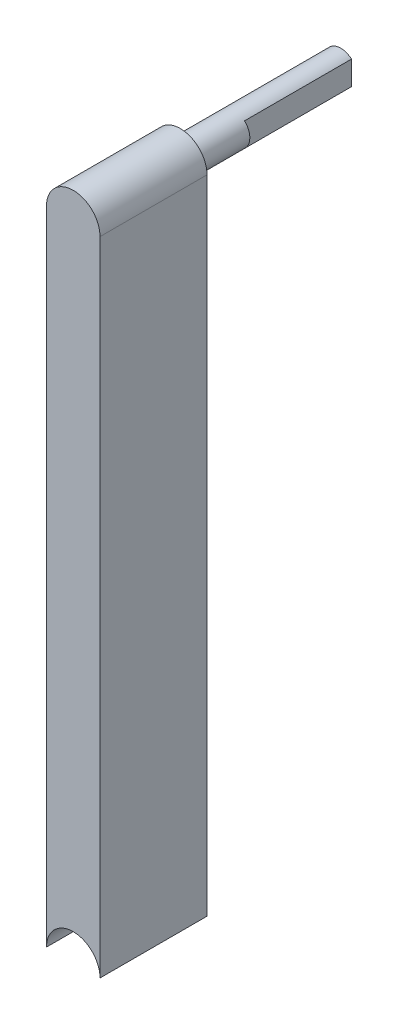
ISO-10303-21;
HEADER;
FILE_DESCRIPTION(('STEP AP214'),'2;1');
FILE_NAME('part.step','',(''),(''),'','','');
FILE_SCHEMA(('AUTOMOTIVE_DESIGN { 1 0 10303 214 1 1 1 1 }'));
ENDSEC;
DATA;
#1=APPLICATION_CONTEXT('core data for automotive mechanical design processes');
#2=APPLICATION_PROTOCOL_DEFINITION('international standard','automotive_design',2000,#1);
#3=PRODUCT_CONTEXT('',#1,'mechanical');
#4=PRODUCT('Part','Part','',(#3));
#5=PRODUCT_RELATED_PRODUCT_CATEGORY('part','',(#4));
#6=PRODUCT_DEFINITION_FORMATION('','',#4);
#7=PRODUCT_DEFINITION_CONTEXT('part definition',#1,'design');
#8=PRODUCT_DEFINITION('design','',#6,#7);
#9=PRODUCT_DEFINITION_SHAPE('','',#8);
#10=(LENGTH_UNIT() NAMED_UNIT(*) SI_UNIT(.MILLI.,.METRE.));
#11=(NAMED_UNIT(*) PLANE_ANGLE_UNIT() SI_UNIT($,.RADIAN.));
#12=(NAMED_UNIT(*) SI_UNIT($,.STERADIAN.) SOLID_ANGLE_UNIT());
#13=UNCERTAINTY_MEASURE_WITH_UNIT(LENGTH_MEASURE(1.E-05),#10,'distance_accuracy_value','');
#14=(GEOMETRIC_REPRESENTATION_CONTEXT(3) GLOBAL_UNCERTAINTY_ASSIGNED_CONTEXT((#13)) GLOBAL_UNIT_ASSIGNED_CONTEXT((#10,
#11,#12)) REPRESENTATION_CONTEXT('',''));
#15=CARTESIAN_POINT('',(0.,0.,0.));
#16=DIRECTION('',(0.,0.,1.));
#17=DIRECTION('',(1.,0.,0.));
#18=AXIS2_PLACEMENT_3D('',#15,#16,#17);
#19=CARTESIAN_POINT('',(0.,0.,0.));
#20=DIRECTION('',(0.,0.,1.));
#21=DIRECTION('',(1.,0.,0.));
#22=AXIS2_PLACEMENT_3D('',#19,#20,#21);
#23=PLANE('',#22);
#24=CARTESIAN_POINT('',(0.,0.,0.));
#25=DIRECTION('',(0.,0.,-1.));
#26=DIRECTION('',(1.,0.,0.));
#27=AXIS2_PLACEMENT_3D('',#24,#25,#26);
#28=CIRCLE('',#27,5.);
#29=CARTESIAN_POINT('',(-5.,0.,0.));
#30=VERTEX_POINT('',#29);
#31=CARTESIAN_POINT('',(5.,0.,0.));
#32=VERTEX_POINT('',#31);
#33=EDGE_CURVE('E114',#30,#32,#28,.T.);
#34=ORIENTED_EDGE('',*,*,#33,.F.);
#35=DIRECTION('',(0.,-1.,0.));
#36=VECTOR('',#35,1.);
#37=CARTESIAN_POINT('',(-5.00000000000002,120.,0.));
#38=LINE('',#37,#36);
#39=CARTESIAN_POINT('',(-5.00000000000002,120.,0.));
#40=VERTEX_POINT('',#39);
#41=EDGE_CURVE('E125',#40,#30,#38,.T.);
#42=ORIENTED_EDGE('',*,*,#41,.F.);
#43=CARTESIAN_POINT('',(0.,120.,0.));
#44=DIRECTION('',(0.,0.,1.));
#45=DIRECTION('',(1.,0.,0.));
#46=AXIS2_PLACEMENT_3D('',#43,#44,#45);
#47=CIRCLE('',#46,5.00000000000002);
#48=CARTESIAN_POINT('',(5.00000000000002,120.,0.));
#49=VERTEX_POINT('',#48);
#50=EDGE_CURVE('E123',#49,#40,#47,.T.);
#51=ORIENTED_EDGE('',*,*,#50,.F.);
#52=DIRECTION('',(0.,1.,0.));
#53=VECTOR('',#52,1.);
#54=CARTESIAN_POINT('',(5.00000000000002,120.,0.));
#55=LINE('',#54,#53);
#56=EDGE_CURVE('E121',#32,#49,#55,.T.);
#57=ORIENTED_EDGE('',*,*,#56,.F.);
#58=EDGE_LOOP('',(#34,#42,#51,#57));
#59=FACE_BOUND('',#58,.T.);
#60=CARTESIAN_POINT('',(0.,120.,0.));
#61=DIRECTION('',(0.,0.,1.));
#62=DIRECTION('',(1.,0.,0.));
#63=AXIS2_PLACEMENT_3D('',#60,#61,#62);
#64=CIRCLE('',#63,3.);
#65=CARTESIAN_POINT('',(3.00000000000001,120.,0.));
#66=VERTEX_POINT('',#65);
#67=EDGE_CURVE('E149',#66,#66,#64,.F.);
#68=ORIENTED_EDGE('',*,*,#67,.F.);
#69=EDGE_LOOP('',(#68));
#70=FACE_BOUND('',#69,.T.);
#71=ADVANCED_FACE('F32',(#59,#70),#23,.F.);
#72=CARTESIAN_POINT('',(0.,0.,20.));
#73=DIRECTION('',(0.,0.,-1.));
#74=DIRECTION('',(-1.,0.,0.));
#75=AXIS2_PLACEMENT_3D('',#72,#73,#74);
#76=CYLINDRICAL_SURFACE('',#75,5.);
#77=ORIENTED_EDGE('',*,*,#33,.T.);
#78=DIRECTION('',(0.,0.,-1.));
#79=VECTOR('',#78,1.);
#80=CARTESIAN_POINT('',(5.,0.,20.));
#81=LINE('',#80,#79);
#82=CARTESIAN_POINT('',(5.,0.,20.));
#83=VERTEX_POINT('',#82);
#84=EDGE_CURVE('E146',#83,#32,#81,.T.);
#85=ORIENTED_EDGE('',*,*,#84,.F.);
#86=CARTESIAN_POINT('',(0.,0.,20.));
#87=DIRECTION('',(0.,0.,-1.));
#88=DIRECTION('',(1.,0.,0.));
#89=AXIS2_PLACEMENT_3D('',#86,#87,#88);
#90=CIRCLE('',#89,5.);
#91=CARTESIAN_POINT('',(-5.,0.,20.));
#92=VERTEX_POINT('',#91);
#93=EDGE_CURVE('E127',#92,#83,#90,.T.);
#94=ORIENTED_EDGE('',*,*,#93,.F.);
#95=DIRECTION('',(0.,0.,-1.));
#96=VECTOR('',#95,1.);
#97=CARTESIAN_POINT('',(-5.,0.,20.));
#98=LINE('',#97,#96);
#99=EDGE_CURVE('E137',#92,#30,#98,.T.);
#100=ORIENTED_EDGE('',*,*,#99,.T.);
#101=EDGE_LOOP('',(#77,#85,#94,#100));
#102=FACE_BOUND('',#101,.T.);
#103=ADVANCED_FACE('F34',(#102),#76,.F.);
#104=CARTESIAN_POINT('',(5.00000000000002,120.,20.));
#105=DIRECTION('',(-1.,0.,0.));
#106=DIRECTION('',(0.,-1.,0.));
#107=AXIS2_PLACEMENT_3D('',#104,#105,#106);
#108=PLANE('',#107);
#109=ORIENTED_EDGE('',*,*,#56,.T.);
#110=DIRECTION('',(0.,0.,-1.));
#111=VECTOR('',#110,1.);
#112=CARTESIAN_POINT('',(5.00000000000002,120.,20.));
#113=LINE('',#112,#111);
#114=CARTESIAN_POINT('',(5.00000000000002,120.,20.));
#115=VERTEX_POINT('',#114);
#116=EDGE_CURVE('E143',#115,#49,#113,.T.);
#117=ORIENTED_EDGE('',*,*,#116,.F.);
#118=DIRECTION('',(0.,1.,0.));
#119=VECTOR('',#118,1.);
#120=CARTESIAN_POINT('',(5.00000000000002,120.,20.));
#121=LINE('',#120,#119);
#122=EDGE_CURVE('E130',#83,#115,#121,.T.);
#123=ORIENTED_EDGE('',*,*,#122,.F.);
#124=ORIENTED_EDGE('',*,*,#84,.T.);
#125=EDGE_LOOP('',(#109,#117,#123,#124));
#126=FACE_BOUND('',#125,.T.);
#127=ADVANCED_FACE('F182',(#126),#108,.F.);
#128=CARTESIAN_POINT('',(0.,120.,20.));
#129=DIRECTION('',(0.,0.,-1.));
#130=DIRECTION('',(-1.,0.,0.));
#131=AXIS2_PLACEMENT_3D('',#128,#129,#130);
#132=CYLINDRICAL_SURFACE('',#131,5.00000000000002);
#133=ORIENTED_EDGE('',*,*,#50,.T.);
#134=DIRECTION('',(0.,0.,-1.));
#135=VECTOR('',#134,1.);
#136=CARTESIAN_POINT('',(-5.00000000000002,120.,20.));
#137=LINE('',#136,#135);
#138=CARTESIAN_POINT('',(-5.00000000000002,120.,20.));
#139=VERTEX_POINT('',#138);
#140=EDGE_CURVE('E140',#139,#40,#137,.T.);
#141=ORIENTED_EDGE('',*,*,#140,.F.);
#142=CARTESIAN_POINT('',(0.,120.,20.));
#143=DIRECTION('',(0.,0.,1.));
#144=DIRECTION('',(1.,0.,0.));
#145=AXIS2_PLACEMENT_3D('',#142,#143,#144);
#146=CIRCLE('',#145,5.00000000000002);
#147=EDGE_CURVE('E131',#115,#139,#146,.T.);
#148=ORIENTED_EDGE('',*,*,#147,.F.);
#149=ORIENTED_EDGE('',*,*,#116,.T.);
#150=EDGE_LOOP('',(#133,#141,#148,#149));
#151=FACE_BOUND('',#150,.T.);
#152=ADVANCED_FACE('F196',(#151),#132,.T.);
#153=CARTESIAN_POINT('',(-5.00000000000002,120.,20.));
#154=DIRECTION('',(1.,0.,0.));
#155=DIRECTION('',(0.,1.,0.));
#156=AXIS2_PLACEMENT_3D('',#153,#154,#155);
#157=PLANE('',#156);
#158=ORIENTED_EDGE('',*,*,#41,.T.);
#159=ORIENTED_EDGE('',*,*,#99,.F.);
#160=DIRECTION('',(0.,-1.,0.));
#161=VECTOR('',#160,1.);
#162=CARTESIAN_POINT('',(-5.00000000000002,120.,20.));
#163=LINE('',#162,#161);
#164=EDGE_CURVE('E135',#139,#92,#163,.T.);
#165=ORIENTED_EDGE('',*,*,#164,.F.);
#166=ORIENTED_EDGE('',*,*,#140,.T.);
#167=EDGE_LOOP('',(#158,#159,#165,#166));
#168=FACE_BOUND('',#167,.T.);
#169=ADVANCED_FACE('F192',(#168),#157,.F.);
#170=CARTESIAN_POINT('',(0.,0.,20.));
#171=DIRECTION('',(0.,0.,1.));
#172=DIRECTION('',(1.,0.,0.));
#173=AXIS2_PLACEMENT_3D('',#170,#171,#172);
#174=PLANE('',#173);
#175=ORIENTED_EDGE('',*,*,#93,.T.);
#176=ORIENTED_EDGE('',*,*,#122,.T.);
#177=ORIENTED_EDGE('',*,*,#147,.T.);
#178=ORIENTED_EDGE('',*,*,#164,.T.);
#179=EDGE_LOOP('',(#175,#176,#177,#178));
#180=FACE_BOUND('',#179,.T.);
#181=ADVANCED_FACE('F189',(#180),#174,.T.);
#182=CARTESIAN_POINT('',(0.,120.,40.781210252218));
#183=DIRECTION('',(0.,0.,1.));
#184=DIRECTION('',(1.,0.,0.));
#185=AXIS2_PLACEMENT_3D('',#182,#183,#184);
#186=CYLINDRICAL_SURFACE('',#185,3.);
#187=CARTESIAN_POINT('',(0.,120.,-30.));
#188=DIRECTION('',(0.,0.,1.));
#189=DIRECTION('',(1.,0.,0.));
#190=AXIS2_PLACEMENT_3D('',#187,#188,#189);
#191=CIRCLE('',#190,3.);
#192=CARTESIAN_POINT('',(-2.,117.7639320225,-30.));
#193=VERTEX_POINT('',#192);
#194=CARTESIAN_POINT('',(2.,117.7639320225,-30.));
#195=VERTEX_POINT('',#194);
#196=EDGE_CURVE('E111',#193,#195,#191,.T.);
#197=ORIENTED_EDGE('',*,*,#196,.T.);
#198=DIRECTION('',(0.,0.,1.));
#199=VECTOR('',#198,1.);
#200=CARTESIAN_POINT('',(2.,117.7639320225,40.781210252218));
#201=LINE('',#200,#199);
#202=CARTESIAN_POINT('',(2.,117.7639320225,-9.99999999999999));
#203=VERTEX_POINT('',#202);
#204=EDGE_CURVE('E47',#195,#203,#201,.T.);
#205=ORIENTED_EDGE('',*,*,#204,.T.);
#206=CARTESIAN_POINT('',(0.,120.,-9.99999999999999));
#207=DIRECTION('',(0.,0.,-1.));
#208=DIRECTION('',(-1.,0.,0.));
#209=AXIS2_PLACEMENT_3D('',#206,#207,#208);
#210=CIRCLE('',#209,3.);
#211=CARTESIAN_POINT('',(2.,122.2360679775,-9.99999999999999));
#212=VERTEX_POINT('',#211);
#213=EDGE_CURVE('E12',#212,#203,#210,.T.);
#214=ORIENTED_EDGE('',*,*,#213,.F.);
#215=DIRECTION('',(0.,0.,1.));
#216=VECTOR('',#215,1.);
#217=CARTESIAN_POINT('',(2.,122.2360679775,40.781210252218));
#218=LINE('',#217,#216);
#219=CARTESIAN_POINT('',(2.,122.2360679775,-30.));
#220=VERTEX_POINT('',#219);
#221=EDGE_CURVE('E97',#212,#220,#218,.F.);
#222=ORIENTED_EDGE('',*,*,#221,.T.);
#223=CARTESIAN_POINT('',(-2.,122.2360679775,-30.));
#224=VERTEX_POINT('',#223);
#225=EDGE_CURVE('E55',#220,#224,#191,.T.);
#226=ORIENTED_EDGE('',*,*,#225,.T.);
#227=DIRECTION('',(0.,0.,1.));
#228=VECTOR('',#227,1.);
#229=CARTESIAN_POINT('',(-2.,122.2360679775,40.781210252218));
#230=LINE('',#229,#228);
#231=CARTESIAN_POINT('',(-2.,122.2360679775,-9.99999999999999));
#232=VERTEX_POINT('',#231);
#233=EDGE_CURVE('E112',#224,#232,#230,.T.);
#234=ORIENTED_EDGE('',*,*,#233,.T.);
#235=CARTESIAN_POINT('',(0.,120.,-9.99999999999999));
#236=DIRECTION('',(0.,0.,-1.));
#237=DIRECTION('',(-1.,0.,0.));
#238=AXIS2_PLACEMENT_3D('',#235,#236,#237);
#239=CIRCLE('',#238,3.);
#240=CARTESIAN_POINT('',(-2.,117.7639320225,-10.));
#241=VERTEX_POINT('',#240);
#242=EDGE_CURVE('E102',#241,#232,#239,.T.);
#243=ORIENTED_EDGE('',*,*,#242,.F.);
#244=DIRECTION('',(0.,0.,1.));
#245=VECTOR('',#244,1.);
#246=CARTESIAN_POINT('',(-2.,117.7639320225,40.781210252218));
#247=LINE('',#246,#245);
#248=EDGE_CURVE('E115',#241,#193,#247,.F.);
#249=ORIENTED_EDGE('',*,*,#248,.T.);
#250=EDGE_LOOP('',(#197,#205,#214,#222,#226,#234,#243,#249));
#251=FACE_BOUND('',#250,.T.);
#252=ORIENTED_EDGE('',*,*,#67,.T.);
#253=EDGE_LOOP('',(#252));
#254=FACE_BOUND('',#253,.T.);
#255=ADVANCED_FACE('F104',(#251,#254),#186,.T.);
#256=CARTESIAN_POINT('',(-2.97258733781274,120.404628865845,-30.));
#257=DIRECTION('',(0.,0.,1.));
#258=DIRECTION('',(1.,0.,0.));
#259=AXIS2_PLACEMENT_3D('',#256,#257,#258);
#260=PLANE('',#259);
#261=ORIENTED_EDGE('',*,*,#225,.F.);
#262=DIRECTION('',(0.,-1.,0.));
#263=VECTOR('',#262,1.);
#264=CARTESIAN_POINT('',(2.,120.404628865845,-30.));
#265=LINE('',#264,#263);
#266=EDGE_CURVE('E40',#220,#195,#265,.T.);
#267=ORIENTED_EDGE('',*,*,#266,.T.);
#268=ORIENTED_EDGE('',*,*,#196,.F.);
#269=DIRECTION('',(0.,1.,0.));
#270=VECTOR('',#269,1.);
#271=CARTESIAN_POINT('',(-2.,120.404628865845,-30.));
#272=LINE('',#271,#270);
#273=EDGE_CURVE('E110',#193,#224,#272,.T.);
#274=ORIENTED_EDGE('',*,*,#273,.T.);
#275=EDGE_LOOP('',(#261,#267,#268,#274));
#276=FACE_BOUND('',#275,.T.);
#277=ADVANCED_FACE('F109',(#276),#260,.F.);
#278=CARTESIAN_POINT('',(0.141542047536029,119.98073328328,-10.));
#279=DIRECTION('',(0.,0.,-1.));
#280=DIRECTION('',(-1.,0.,0.));
#281=AXIS2_PLACEMENT_3D('',#278,#279,#280);
#282=PLANE('',#281);
#283=ORIENTED_EDGE('',*,*,#242,.T.);
#284=DIRECTION('',(0.,-1.,0.));
#285=VECTOR('',#284,1.);
#286=CARTESIAN_POINT('',(-2.,110.21273463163,-10.));
#287=LINE('',#286,#285);
#288=EDGE_CURVE('E158',#232,#241,#287,.T.);
#289=ORIENTED_EDGE('',*,*,#288,.T.);
#290=EDGE_LOOP('',(#283,#289));
#291=FACE_BOUND('',#290,.T.);
#292=ADVANCED_FACE('F157',(#291),#282,.T.);
#293=CARTESIAN_POINT('',(-2.,110.21273463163,-10.));
#294=DIRECTION('',(1.,0.,0.));
#295=DIRECTION('',(0.,1.,0.));
#296=AXIS2_PLACEMENT_3D('',#293,#294,#295);
#297=PLANE('',#296);
#298=ORIENTED_EDGE('',*,*,#273,.F.);
#299=ORIENTED_EDGE('',*,*,#248,.F.);
#300=ORIENTED_EDGE('',*,*,#288,.F.);
#301=ORIENTED_EDGE('',*,*,#233,.F.);
#302=EDGE_LOOP('',(#298,#299,#300,#301));
#303=FACE_BOUND('',#302,.T.);
#304=ADVANCED_FACE('F161',(#303),#297,.F.);
#305=CARTESIAN_POINT('',(0.141542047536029,119.98073328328,-10.));
#306=DIRECTION('',(0.,0.,-1.));
#307=DIRECTION('',(-1.,0.,0.));
#308=AXIS2_PLACEMENT_3D('',#305,#306,#307);
#309=PLANE('',#308);
#310=ORIENTED_EDGE('',*,*,#213,.T.);
#311=DIRECTION('',(0.,1.,0.));
#312=VECTOR('',#311,1.);
#313=CARTESIAN_POINT('',(2.00000000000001,129.806522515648,-10.));
#314=LINE('',#313,#312);
#315=EDGE_CURVE('E106',#203,#212,#314,.T.);
#316=ORIENTED_EDGE('',*,*,#315,.T.);
#317=EDGE_LOOP('',(#310,#316));
#318=FACE_BOUND('',#317,.T.);
#319=ADVANCED_FACE('F166',(#318),#309,.T.);
#320=CARTESIAN_POINT('',(2.00000000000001,129.806522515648,-10.));
#321=DIRECTION('',(-1.,0.,0.));
#322=DIRECTION('',(0.,-1.,0.));
#323=AXIS2_PLACEMENT_3D('',#320,#321,#322);
#324=PLANE('',#323);
#325=ORIENTED_EDGE('',*,*,#266,.F.);
#326=ORIENTED_EDGE('',*,*,#221,.F.);
#327=ORIENTED_EDGE('',*,*,#315,.F.);
#328=ORIENTED_EDGE('',*,*,#204,.F.);
#329=EDGE_LOOP('',(#325,#326,#327,#328));
#330=FACE_BOUND('',#329,.T.);
#331=ADVANCED_FACE('F96',(#330),#324,.F.);
#332=CLOSED_SHELL('',(#71,#103,#127,#152,#169,#181,#255,#277,#292,#304,#319,#331));
#333=MANIFOLD_SOLID_BREP('B2',#332);
#334=ADVANCED_BREP_SHAPE_REPRESENTATION('',(#18,#333),#14);
#335=SHAPE_DEFINITION_REPRESENTATION(#9,#334);
ENDSEC;
END-ISO-10303-21;
